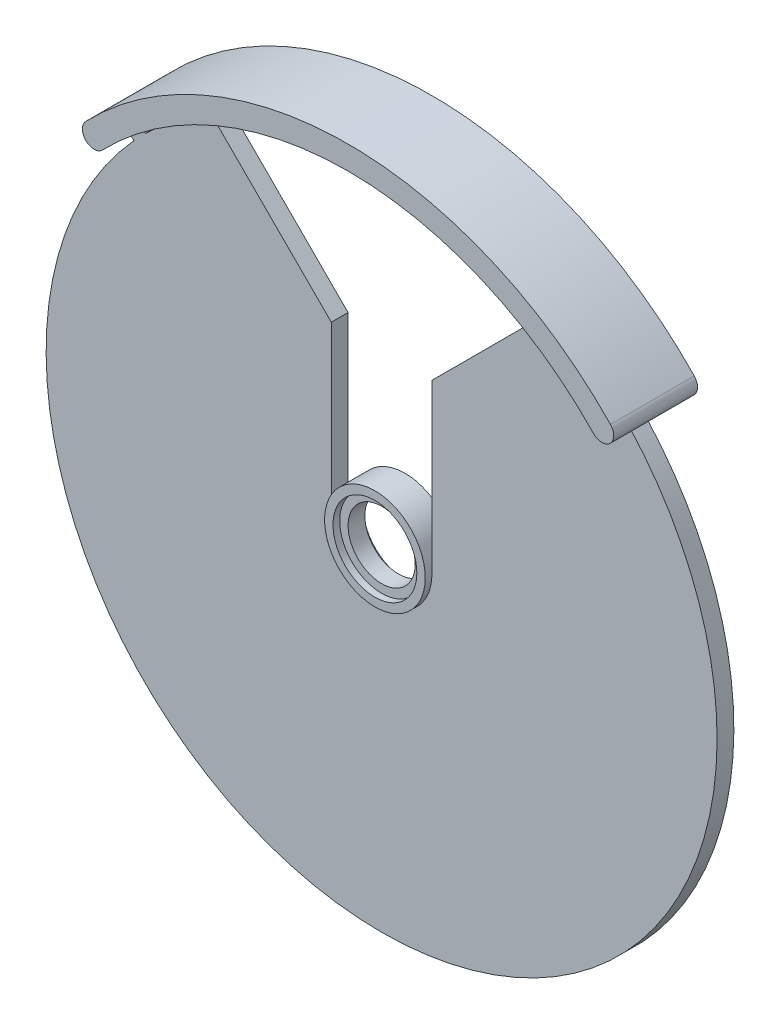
ISO-10303-21;
HEADER;
FILE_DESCRIPTION(('STEP AP214'),'2;1');
FILE_NAME('part.step','',(''),(''),'','','');
FILE_SCHEMA(('AUTOMOTIVE_DESIGN { 1 0 10303 214 1 1 1 1 }'));
ENDSEC;
DATA;
#1=APPLICATION_CONTEXT('core data for automotive mechanical design processes');
#2=APPLICATION_PROTOCOL_DEFINITION('international standard','automotive_design',2000,#1);
#3=PRODUCT_CONTEXT('',#1,'mechanical');
#4=PRODUCT('Part','Part','',(#3));
#5=PRODUCT_RELATED_PRODUCT_CATEGORY('part','',(#4));
#6=PRODUCT_DEFINITION_FORMATION('','',#4);
#7=PRODUCT_DEFINITION_CONTEXT('part definition',#1,'design');
#8=PRODUCT_DEFINITION('design','',#6,#7);
#9=PRODUCT_DEFINITION_SHAPE('','',#8);
#10=(LENGTH_UNIT() NAMED_UNIT(*) SI_UNIT(.MILLI.,.METRE.));
#11=(NAMED_UNIT(*) PLANE_ANGLE_UNIT() SI_UNIT($,.RADIAN.));
#12=(NAMED_UNIT(*) SI_UNIT($,.STERADIAN.) SOLID_ANGLE_UNIT());
#13=UNCERTAINTY_MEASURE_WITH_UNIT(LENGTH_MEASURE(1.E-05),#10,'distance_accuracy_value','');
#14=(GEOMETRIC_REPRESENTATION_CONTEXT(3) GLOBAL_UNCERTAINTY_ASSIGNED_CONTEXT((#13)) GLOBAL_UNIT_ASSIGNED_CONTEXT((#10,
#11,#12)) REPRESENTATION_CONTEXT('',''));
#15=CARTESIAN_POINT('',(0.,0.,0.));
#16=DIRECTION('',(0.,0.,1.));
#17=DIRECTION('',(1.,0.,0.));
#18=AXIS2_PLACEMENT_3D('',#15,#16,#17);
#19=CARTESIAN_POINT('',(0.,0.,1.27));
#20=DIRECTION('',(0.,0.,1.));
#21=DIRECTION('',(1.,0.,0.));
#22=AXIS2_PLACEMENT_3D('',#19,#20,#21);
#23=PLANE('',#22);
#24=CARTESIAN_POINT('',(19.224441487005,18.4896662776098,1.27));
#25=DIRECTION('',(0.,0.,1.));
#26=DIRECTION('',(1.,0.,0.));
#27=AXIS2_PLACEMENT_3D('',#24,#25,#26);
#28=CIRCLE('',#27,0.889);
#29=CARTESIAN_POINT('',(18.5836979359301,17.8734125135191,1.27));
#30=VERTEX_POINT('',#29);
#31=CARTESIAN_POINT('',(19.224441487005,17.6006662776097,1.27));
#32=VERTEX_POINT('',#31);
#33=EDGE_CURVE('E282',#30,#32,#28,.T.);
#34=ORIENTED_EDGE('',*,*,#33,.F.);
#35=CARTESIAN_POINT('',(0.,0.,1.27));
#36=DIRECTION('',(0.,0.,1.));
#37=DIRECTION('',(1.,0.,0.));
#38=AXIS2_PLACEMENT_3D('',#35,#36,#37);
#39=CIRCLE('',#38,25.7839621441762);
#40=CARTESIAN_POINT('',(18.1547390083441,18.3089637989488,1.27));
#41=VERTEX_POINT('',#40);
#42=EDGE_CURVE('E284',#30,#41,#39,.T.);
#43=ORIENTED_EDGE('',*,*,#42,.T.);
#44=DIRECTION('',(0.707106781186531,0.707106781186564,0.));
#45=VECTOR('',#44,1.);
#46=CARTESIAN_POINT('',(-0.0771123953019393,0.0771123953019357,1.27));
#47=LINE('',#46,#45);
#48=CARTESIAN_POINT('',(17.8832343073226,18.0374590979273,1.27));
#49=VERTEX_POINT('',#48);
#50=EDGE_CURVE('E330',#49,#41,#47,.T.);
#51=ORIENTED_EDGE('',*,*,#50,.F.);
#52=CARTESIAN_POINT('',(0.,0.,1.27));
#53=DIRECTION('',(0.,0.,1.));
#54=DIRECTION('',(1.,0.,0.));
#55=AXIS2_PLACEMENT_3D('',#52,#53,#54);
#56=CIRCLE('',#55,25.4);
#57=CARTESIAN_POINT('',(12.9567807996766,21.8467807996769,1.27));
#58=VERTEX_POINT('',#57);
#59=EDGE_CURVE('E219',#49,#58,#56,.T.);
#60=ORIENTED_EDGE('',*,*,#59,.T.);
#61=DIRECTION('',(0.707106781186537,0.707106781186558,0.));
#62=VECTOR('',#61,1.);
#63=CARTESIAN_POINT('',(-4.44499999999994,4.44499999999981,1.27));
#64=LINE('',#63,#62);
#65=CARTESIAN_POINT('',(3.81,12.7,1.27));
#66=VERTEX_POINT('',#65);
#67=EDGE_CURVE('E391',#66,#58,#64,.T.);
#68=ORIENTED_EDGE('',*,*,#67,.F.);
#69=DIRECTION('',(0.,1.,0.));
#70=VECTOR('',#69,1.);
#71=CARTESIAN_POINT('',(3.81,0.,1.27));
#72=LINE('',#71,#70);
#73=CARTESIAN_POINT('',(3.81,0.,1.27));
#74=VERTEX_POINT('',#73);
#75=EDGE_CURVE('E393',#74,#66,#72,.T.);
#76=ORIENTED_EDGE('',*,*,#75,.F.);
#77=CARTESIAN_POINT('',(0.,0.,1.27));
#78=DIRECTION('',(0.,0.,1.));
#79=DIRECTION('',(1.,0.,0.));
#80=AXIS2_PLACEMENT_3D('',#77,#78,#79);
#81=CIRCLE('',#80,3.81);
#82=CARTESIAN_POINT('',(-3.81,0.,1.27));
#83=VERTEX_POINT('',#82);
#84=EDGE_CURVE('E397',#83,#74,#81,.T.);
#85=ORIENTED_EDGE('',*,*,#84,.F.);
#86=DIRECTION('',(0.,1.,0.));
#87=VECTOR('',#86,1.);
#88=CARTESIAN_POINT('',(-3.81,0.,1.27));
#89=LINE('',#88,#87);
#90=CARTESIAN_POINT('',(-3.81,12.7,1.27));
#91=VERTEX_POINT('',#90);
#92=EDGE_CURVE('E384',#83,#91,#89,.T.);
#93=ORIENTED_EDGE('',*,*,#92,.T.);
#94=DIRECTION('',(-0.707106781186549,0.707106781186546,0.));
#95=VECTOR('',#94,1.);
#96=CARTESIAN_POINT('',(4.44500000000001,4.44500000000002,1.27));
#97=LINE('',#96,#95);
#98=CARTESIAN_POINT('',(-12.9567807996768,21.8467807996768,1.27));
#99=VERTEX_POINT('',#98);
#100=EDGE_CURVE('E389',#91,#99,#97,.T.);
#101=ORIENTED_EDGE('',*,*,#100,.T.);
#102=CARTESIAN_POINT('',(-17.8832343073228,18.0374590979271,1.27));
#103=VERTEX_POINT('',#102);
#104=EDGE_CURVE('E220',#99,#103,#56,.T.);
#105=ORIENTED_EDGE('',*,*,#104,.T.);
#106=DIRECTION('',(-0.707106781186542,0.707106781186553,0.));
#107=VECTOR('',#106,1.);
#108=CARTESIAN_POINT('',(0.0771123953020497,0.0771123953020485,1.27));
#109=LINE('',#108,#107);
#110=CARTESIAN_POINT('',(-18.1547390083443,18.3089637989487,1.27));
#111=VERTEX_POINT('',#110);
#112=EDGE_CURVE('E206',#103,#111,#109,.T.);
#113=ORIENTED_EDGE('',*,*,#112,.T.);
#114=CARTESIAN_POINT('',(-18.5836979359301,17.8734125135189,1.27));
#115=VERTEX_POINT('',#114);
#116=EDGE_CURVE('E50',#111,#115,#39,.T.);
#117=ORIENTED_EDGE('',*,*,#116,.T.);
#118=CARTESIAN_POINT('',(-19.2244414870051,18.4896662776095,1.27));
#119=DIRECTION('',(0.,0.,1.));
#120=DIRECTION('',(1.,0.,0.));
#121=AXIS2_PLACEMENT_3D('',#118,#119,#120);
#122=CIRCLE('',#121,0.889);
#123=CARTESIAN_POINT('',(-19.2244414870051,17.6006662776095,1.27));
#124=VERTEX_POINT('',#123);
#125=EDGE_CURVE('E226',#124,#115,#122,.T.);
#126=ORIENTED_EDGE('',*,*,#125,.F.);
#127=DIRECTION('',(-0.707106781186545,0.70710678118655,0.));
#128=VECTOR('',#127,1.);
#129=CARTESIAN_POINT('',(-0.811887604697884,-0.811887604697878,1.27));
#130=LINE('',#129,#128);
#131=CARTESIAN_POINT('',(-18.7540401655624,17.1302649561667,1.27));
#132=VERTEX_POINT('',#131);
#133=EDGE_CURVE('E200',#132,#124,#130,.T.);
#134=ORIENTED_EDGE('',*,*,#133,.F.);
#135=CARTESIAN_POINT('',(18.7540401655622,17.1302649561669,1.27));
#136=VERTEX_POINT('',#135);
#137=EDGE_CURVE('E215',#132,#136,#56,.T.);
#138=ORIENTED_EDGE('',*,*,#137,.T.);
#139=DIRECTION('',(-0.707106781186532,-0.707106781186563,0.));
#140=VECTOR('',#139,1.);
#141=CARTESIAN_POINT('',(0.811887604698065,-0.811887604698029,1.27));
#142=LINE('',#141,#140);
#143=EDGE_CURVE('E286',#32,#136,#142,.T.);
#144=ORIENTED_EDGE('',*,*,#143,.F.);
#145=EDGE_LOOP('',(#34,#43,#51,#60,#68,#76,#85,#93,#101,#105,#113,#117,#126,#134,#138,#144));
#146=FACE_BOUND('',#145,.T.);
#147=ADVANCED_FACE('F35',(#146),#23,.T.);
#148=CARTESIAN_POINT('',(0.,0.,0.));
#149=DIRECTION('',(0.,0.,1.));
#150=DIRECTION('',(1.,0.,0.));
#151=AXIS2_PLACEMENT_3D('',#148,#149,#150);
#152=PLANE('',#151);
#153=CARTESIAN_POINT('',(0.,0.,0.));
#154=DIRECTION('',(0.,0.,1.));
#155=DIRECTION('',(1.,0.,0.));
#156=AXIS2_PLACEMENT_3D('',#153,#154,#155);
#157=CIRCLE('',#156,25.7839621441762);
#158=CARTESIAN_POINT('',(18.5836979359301,17.8734125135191,0.));
#159=VERTEX_POINT('',#158);
#160=CARTESIAN_POINT('',(18.1547390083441,18.3089637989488,0.));
#161=VERTEX_POINT('',#160);
#162=EDGE_CURVE('E58',#159,#161,#157,.T.);
#163=ORIENTED_EDGE('',*,*,#162,.F.);
#164=CARTESIAN_POINT('',(19.224441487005,18.4896662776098,0.));
#165=DIRECTION('',(0.,0.,-1.));
#166=DIRECTION('',(-1.,0.,0.));
#167=AXIS2_PLACEMENT_3D('',#164,#165,#166);
#168=CIRCLE('',#167,0.889);
#169=CARTESIAN_POINT('',(19.224441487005,17.6006662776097,0.));
#170=VERTEX_POINT('',#169);
#171=EDGE_CURVE('E324',#170,#159,#168,.T.);
#172=ORIENTED_EDGE('',*,*,#171,.F.);
#173=DIRECTION('',(-0.707106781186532,-0.707106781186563,0.));
#174=VECTOR('',#173,1.);
#175=CARTESIAN_POINT('',(0.811887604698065,-0.811887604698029,0.));
#176=LINE('',#175,#174);
#177=CARTESIAN_POINT('',(18.7540401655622,17.1302649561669,0.));
#178=VERTEX_POINT('',#177);
#179=EDGE_CURVE('E333',#170,#178,#176,.T.);
#180=ORIENTED_EDGE('',*,*,#179,.T.);
#181=CARTESIAN_POINT('',(0.,0.,0.));
#182=DIRECTION('',(0.,0.,1.));
#183=DIRECTION('',(1.,0.,0.));
#184=AXIS2_PLACEMENT_3D('',#181,#182,#183);
#185=CIRCLE('',#184,25.4);
#186=CARTESIAN_POINT('',(-18.7540401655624,17.1302649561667,0.));
#187=VERTEX_POINT('',#186);
#188=EDGE_CURVE('E221',#187,#178,#185,.T.);
#189=ORIENTED_EDGE('',*,*,#188,.F.);
#190=DIRECTION('',(0.707106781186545,-0.70710678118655,0.));
#191=VECTOR('',#190,1.);
#192=CARTESIAN_POINT('',(-0.811887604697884,-0.811887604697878,0.));
#193=LINE('',#192,#191);
#194=CARTESIAN_POINT('',(-19.2244414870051,17.6006662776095,0.));
#195=VERTEX_POINT('',#194);
#196=EDGE_CURVE('E347',#195,#187,#193,.T.);
#197=ORIENTED_EDGE('',*,*,#196,.F.);
#198=CARTESIAN_POINT('',(-19.2244414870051,18.4896662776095,0.));
#199=DIRECTION('',(0.,0.,1.));
#200=DIRECTION('',(1.,0.,0.));
#201=AXIS2_PLACEMENT_3D('',#198,#199,#200);
#202=CIRCLE('',#201,0.889);
#203=CARTESIAN_POINT('',(-18.5836979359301,17.8734125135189,0.));
#204=VERTEX_POINT('',#203);
#205=EDGE_CURVE('E218',#204,#195,#202,.F.);
#206=ORIENTED_EDGE('',*,*,#205,.F.);
#207=CARTESIAN_POINT('',(-18.1547390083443,18.3089637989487,0.));
#208=VERTEX_POINT('',#207);
#209=EDGE_CURVE('E189',#208,#204,#157,.T.);
#210=ORIENTED_EDGE('',*,*,#209,.F.);
#211=DIRECTION('',(0.707106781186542,-0.707106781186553,0.));
#212=VECTOR('',#211,1.);
#213=CARTESIAN_POINT('',(0.0771123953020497,0.0771123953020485,0.));
#214=LINE('',#213,#212);
#215=CARTESIAN_POINT('',(-17.8832343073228,18.0374590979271,0.));
#216=VERTEX_POINT('',#215);
#217=EDGE_CURVE('E340',#208,#216,#214,.T.);
#218=ORIENTED_EDGE('',*,*,#217,.T.);
#219=CARTESIAN_POINT('',(-12.9567807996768,21.8467807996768,0.));
#220=VERTEX_POINT('',#219);
#221=EDGE_CURVE('E213',#220,#216,#185,.T.);
#222=ORIENTED_EDGE('',*,*,#221,.F.);
#223=DIRECTION('',(-0.707106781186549,0.707106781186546,0.));
#224=VECTOR('',#223,1.);
#225=CARTESIAN_POINT('',(4.44500000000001,4.44500000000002,0.));
#226=LINE('',#225,#224);
#227=CARTESIAN_POINT('',(-3.81,12.7,0.));
#228=VERTEX_POINT('',#227);
#229=EDGE_CURVE('E290',#228,#220,#226,.T.);
#230=ORIENTED_EDGE('',*,*,#229,.F.);
#231=DIRECTION('',(0.,1.,0.));
#232=VECTOR('',#231,1.);
#233=CARTESIAN_POINT('',(-3.81,0.,0.));
#234=LINE('',#233,#232);
#235=CARTESIAN_POINT('',(-3.81,0.,0.));
#236=VERTEX_POINT('',#235);
#237=EDGE_CURVE('E250',#236,#228,#234,.T.);
#238=ORIENTED_EDGE('',*,*,#237,.F.);
#239=CARTESIAN_POINT('',(0.,0.,0.));
#240=DIRECTION('',(0.,0.,1.));
#241=DIRECTION('',(1.,0.,0.));
#242=AXIS2_PLACEMENT_3D('',#239,#240,#241);
#243=CIRCLE('',#242,3.81);
#244=CARTESIAN_POINT('',(3.81,0.,0.));
#245=VERTEX_POINT('',#244);
#246=EDGE_CURVE('E302',#236,#245,#243,.T.);
#247=ORIENTED_EDGE('',*,*,#246,.T.);
#248=DIRECTION('',(0.,1.,0.));
#249=VECTOR('',#248,1.);
#250=CARTESIAN_POINT('',(3.81,0.,0.));
#251=LINE('',#250,#249);
#252=CARTESIAN_POINT('',(3.81,12.7,0.));
#253=VERTEX_POINT('',#252);
#254=EDGE_CURVE('E247',#245,#253,#251,.T.);
#255=ORIENTED_EDGE('',*,*,#254,.T.);
#256=DIRECTION('',(0.707106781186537,0.707106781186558,0.));
#257=VECTOR('',#256,1.);
#258=CARTESIAN_POINT('',(-4.44499999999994,4.44499999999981,0.));
#259=LINE('',#258,#257);
#260=CARTESIAN_POINT('',(12.9567807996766,21.8467807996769,0.));
#261=VERTEX_POINT('',#260);
#262=EDGE_CURVE('E370',#253,#261,#259,.T.);
#263=ORIENTED_EDGE('',*,*,#262,.T.);
#264=CARTESIAN_POINT('',(17.8832343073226,18.0374590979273,0.));
#265=VERTEX_POINT('',#264);
#266=EDGE_CURVE('E224',#265,#261,#185,.T.);
#267=ORIENTED_EDGE('',*,*,#266,.F.);
#268=DIRECTION('',(0.707106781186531,0.707106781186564,0.));
#269=VECTOR('',#268,1.);
#270=CARTESIAN_POINT('',(-0.0771123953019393,0.0771123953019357,0.));
#271=LINE('',#270,#269);
#272=EDGE_CURVE('E331',#265,#161,#271,.T.);
#273=ORIENTED_EDGE('',*,*,#272,.T.);
#274=EDGE_LOOP('',(#163,#172,#180,#189,#197,#206,#210,#218,#222,#230,#238,#247,#255,#263,#267,#273));
#275=FACE_BOUND('',#274,.T.);
#276=ADVANCED_FACE('F270',(#275),#152,.F.);
#277=CARTESIAN_POINT('',(0.0771123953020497,0.0771123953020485,2.54));
#278=DIRECTION('',(0.707106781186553,0.707106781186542,0.));
#279=DIRECTION('',(-0.707106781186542,0.707106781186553,0.));
#280=AXIS2_PLACEMENT_3D('',#277,#278,#279);
#281=PLANE('',#280);
#282=ORIENTED_EDGE('',*,*,#217,.F.);
#283=DIRECTION('',(0.,0.,1.));
#284=VECTOR('',#283,1.);
#285=CARTESIAN_POINT('',(-18.1547390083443,18.3089637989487,-43.9818813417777));
#286=LINE('',#285,#284);
#287=EDGE_CURVE('E295',#208,#111,#286,.T.);
#288=ORIENTED_EDGE('',*,*,#287,.T.);
#289=ORIENTED_EDGE('',*,*,#112,.F.);
#290=DIRECTION('',(0.,0.,-1.));
#291=VECTOR('',#290,1.);
#292=CARTESIAN_POINT('',(-17.8832343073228,18.0374590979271,2.54));
#293=LINE('',#292,#291);
#294=EDGE_CURVE('E210',#103,#216,#293,.T.);
#295=ORIENTED_EDGE('',*,*,#294,.T.);
#296=EDGE_LOOP('',(#282,#288,#289,#295));
#297=FACE_BOUND('',#296,.T.);
#298=ADVANCED_FACE('F278',(#297),#281,.T.);
#299=CARTESIAN_POINT('',(19.224441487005,18.4896662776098,0.));
#300=DIRECTION('',(0.,0.,1.));
#301=DIRECTION('',(1.,0.,0.));
#302=AXIS2_PLACEMENT_3D('',#299,#300,#301);
#303=CYLINDRICAL_SURFACE('',#302,0.889000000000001);
#304=DIRECTION('',(0.,0.,1.));
#305=VECTOR('',#304,1.);
#306=CARTESIAN_POINT('',(18.58369793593,17.8734125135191,-43.9818813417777));
#307=LINE('',#306,#305);
#308=CARTESIAN_POINT('',(18.5836979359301,17.8734125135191,-2.54));
#309=VERTEX_POINT('',#308);
#310=EDGE_CURVE('E308',#309,#159,#307,.T.);
#311=ORIENTED_EDGE('',*,*,#310,.F.);
#312=CARTESIAN_POINT('',(19.224441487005,18.4896662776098,-2.54));
#313=DIRECTION('',(0.,0.,-1.));
#314=DIRECTION('',(-1.,0.,0.));
#315=AXIS2_PLACEMENT_3D('',#312,#313,#314);
#316=CIRCLE('',#315,0.889);
#317=CARTESIAN_POINT('',(19.86518503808,19.1059200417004,-2.54));
#318=VERTEX_POINT('',#317);
#319=EDGE_CURVE('E181',#318,#309,#316,.T.);
#320=ORIENTED_EDGE('',*,*,#319,.F.);
#321=DIRECTION('',(0.,0.,1.));
#322=VECTOR('',#321,1.);
#323=CARTESIAN_POINT('',(19.86518503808,19.1059200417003,-43.9818813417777));
#324=LINE('',#323,#322);
#325=CARTESIAN_POINT('',(19.86518503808,19.1059200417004,3.81));
#326=VERTEX_POINT('',#325);
#327=EDGE_CURVE('E311',#318,#326,#324,.T.);
#328=ORIENTED_EDGE('',*,*,#327,.T.);
#329=CARTESIAN_POINT('',(19.224441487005,18.4896662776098,3.81));
#330=DIRECTION('',(0.,0.,1.));
#331=DIRECTION('',(1.,0.,0.));
#332=AXIS2_PLACEMENT_3D('',#329,#330,#331);
#333=CIRCLE('',#332,0.889);
#334=CARTESIAN_POINT('',(18.5836979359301,17.8734125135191,3.81));
#335=VERTEX_POINT('',#334);
#336=EDGE_CURVE('E289',#335,#326,#333,.T.);
#337=ORIENTED_EDGE('',*,*,#336,.F.);
#338=EDGE_CURVE('E192',#30,#335,#307,.T.);
#339=ORIENTED_EDGE('',*,*,#338,.F.);
#340=ORIENTED_EDGE('',*,*,#33,.T.);
#341=DIRECTION('',(0.,0.,1.));
#342=VECTOR('',#341,1.);
#343=CARTESIAN_POINT('',(19.224441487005,17.6006662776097,0.));
#344=LINE('',#343,#342);
#345=EDGE_CURVE('E338',#170,#32,#344,.T.);
#346=ORIENTED_EDGE('',*,*,#345,.F.);
#347=ORIENTED_EDGE('',*,*,#171,.T.);
#348=EDGE_LOOP('',(#311,#320,#328,#337,#339,#340,#346,#347));
#349=FACE_BOUND('',#348,.T.);
#350=ADVANCED_FACE('F458',(#349),#303,.T.);
#351=CARTESIAN_POINT('',(-0.0771123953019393,0.0771123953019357,0.));
#352=DIRECTION('',(0.707106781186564,-0.707106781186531,0.));
#353=DIRECTION('',(0.707106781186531,0.707106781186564,0.));
#354=AXIS2_PLACEMENT_3D('',#351,#352,#353);
#355=PLANE('',#354);
#356=DIRECTION('',(0.,0.,1.));
#357=VECTOR('',#356,1.);
#358=CARTESIAN_POINT('',(18.1547390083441,18.3089637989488,-43.9818813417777));
#359=LINE('',#358,#357);
#360=EDGE_CURVE('E294',#161,#41,#359,.T.);
#361=ORIENTED_EDGE('',*,*,#360,.F.);
#362=ORIENTED_EDGE('',*,*,#272,.F.);
#363=DIRECTION('',(0.,0.,1.));
#364=VECTOR('',#363,1.);
#365=CARTESIAN_POINT('',(17.8832343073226,18.0374590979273,0.));
#366=LINE('',#365,#364);
#367=EDGE_CURVE('E335',#265,#49,#366,.T.);
#368=ORIENTED_EDGE('',*,*,#367,.T.);
#369=ORIENTED_EDGE('',*,*,#50,.T.);
#370=EDGE_LOOP('',(#361,#362,#368,#369));
#371=FACE_BOUND('',#370,.T.);
#372=ADVANCED_FACE('F268',(#371),#355,.F.);
#373=CARTESIAN_POINT('',(0.,0.,0.));
#374=DIRECTION('',(0.,0.,1.));
#375=DIRECTION('',(1.,0.,0.));
#376=AXIS2_PLACEMENT_3D('',#373,#374,#375);
#377=CIRCLE('',#376,2.54);
#378=CARTESIAN_POINT('',(2.54,0.,0.));
#379=VERTEX_POINT('',#378);
#380=EDGE_CURVE('E199',#379,#379,#377,.T.);
#381=ORIENTED_EDGE('',*,*,#380,.T.);
#382=EDGE_LOOP('',(#381));
#383=FACE_BOUND('',#382,.T.);
#384=CARTESIAN_POINT('',(0.,0.,0.));
#385=DIRECTION('',(0.,0.,1.));
#386=DIRECTION('',(1.,0.,0.));
#387=AXIS2_PLACEMENT_3D('',#384,#385,#386);
#388=CIRCLE('',#387,3.175);
#389=CARTESIAN_POINT('',(3.175,0.,0.));
#390=VERTEX_POINT('',#389);
#391=EDGE_CURVE('E11',#390,#390,#388,.T.);
#392=ORIENTED_EDGE('',*,*,#391,.F.);
#393=EDGE_LOOP('',(#392));
#394=FACE_BOUND('',#393,.T.);
#395=ADVANCED_FACE('F259',(#383,#394),#152,.F.);
#396=CARTESIAN_POINT('',(0.,0.,1.27));
#397=DIRECTION('',(0.,0.,1.));
#398=DIRECTION('',(1.,0.,0.));
#399=AXIS2_PLACEMENT_3D('',#396,#397,#398);
#400=CIRCLE('',#399,2.54);
#401=CARTESIAN_POINT('',(2.54,0.,1.27));
#402=VERTEX_POINT('',#401);
#403=EDGE_CURVE('E203',#402,#402,#400,.T.);
#404=ORIENTED_EDGE('',*,*,#403,.F.);
#405=EDGE_LOOP('',(#404));
#406=FACE_BOUND('',#405,.T.);
#407=CARTESIAN_POINT('',(0.,0.,1.27));
#408=DIRECTION('',(0.,0.,1.));
#409=DIRECTION('',(1.,0.,0.));
#410=AXIS2_PLACEMENT_3D('',#407,#408,#409);
#411=CIRCLE('',#410,3.175);
#412=CARTESIAN_POINT('',(3.175,0.,1.27));
#413=VERTEX_POINT('',#412);
#414=EDGE_CURVE('E43',#413,#413,#411,.F.);
#415=ORIENTED_EDGE('',*,*,#414,.F.);
#416=EDGE_LOOP('',(#415));
#417=FACE_BOUND('',#416,.T.);
#418=ADVANCED_FACE('F256',(#406,#417),#23,.T.);
#419=CARTESIAN_POINT('',(0.,0.,1.27));
#420=DIRECTION('',(0.,0.,-1.));
#421=DIRECTION('',(-1.,0.,0.));
#422=AXIS2_PLACEMENT_3D('',#419,#420,#421);
#423=CYLINDRICAL_SURFACE('',#422,25.4);
#424=DIRECTION('',(0.,0.,-1.));
#425=VECTOR('',#424,1.);
#426=CARTESIAN_POINT('',(-12.9567807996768,21.8467807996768,1.27));
#427=LINE('',#426,#425);
#428=EDGE_CURVE('E245',#220,#99,#427,.F.);
#429=ORIENTED_EDGE('',*,*,#428,.F.);
#430=ORIENTED_EDGE('',*,*,#221,.T.);
#431=ORIENTED_EDGE('',*,*,#294,.F.);
#432=ORIENTED_EDGE('',*,*,#104,.F.);
#433=EDGE_LOOP('',(#429,#430,#431,#432));
#434=FACE_BOUND('',#433,.T.);
#435=ADVANCED_FACE('F258',(#434),#423,.T.);
#436=DIRECTION('',(0.,0.,1.));
#437=VECTOR('',#436,1.);
#438=CARTESIAN_POINT('',(18.7540401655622,17.1302649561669,0.));
#439=LINE('',#438,#437);
#440=EDGE_CURVE('E341',#178,#136,#439,.T.);
#441=ORIENTED_EDGE('',*,*,#440,.T.);
#442=ORIENTED_EDGE('',*,*,#137,.F.);
#443=DIRECTION('',(0.,0.,-1.));
#444=VECTOR('',#443,1.);
#445=CARTESIAN_POINT('',(-18.7540401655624,17.1302649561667,2.54));
#446=LINE('',#445,#444);
#447=EDGE_CURVE('E240',#132,#187,#446,.T.);
#448=ORIENTED_EDGE('',*,*,#447,.T.);
#449=ORIENTED_EDGE('',*,*,#188,.T.);
#450=EDGE_LOOP('',(#441,#442,#448,#449));
#451=FACE_BOUND('',#450,.T.);
#452=ADVANCED_FACE('F37',(#451),#423,.T.);
#453=ORIENTED_EDGE('',*,*,#266,.T.);
#454=DIRECTION('',(0.,0.,-1.));
#455=VECTOR('',#454,1.);
#456=CARTESIAN_POINT('',(12.9567807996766,21.8467807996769,1.27));
#457=LINE('',#456,#455);
#458=EDGE_CURVE('E232',#261,#58,#457,.F.);
#459=ORIENTED_EDGE('',*,*,#458,.T.);
#460=ORIENTED_EDGE('',*,*,#59,.F.);
#461=ORIENTED_EDGE('',*,*,#367,.F.);
#462=EDGE_LOOP('',(#453,#459,#460,#461));
#463=FACE_BOUND('',#462,.T.);
#464=ADVANCED_FACE('F267',(#463),#423,.T.);
#465=CARTESIAN_POINT('',(0.,0.,1.27));
#466=DIRECTION('',(0.,0.,-1.));
#467=DIRECTION('',(-1.,0.,0.));
#468=AXIS2_PLACEMENT_3D('',#465,#466,#467);
#469=CYLINDRICAL_SURFACE('',#468,2.54);
#470=ORIENTED_EDGE('',*,*,#403,.T.);
#471=EDGE_LOOP('',(#470));
#472=FACE_BOUND('',#471,.T.);
#473=ORIENTED_EDGE('',*,*,#380,.F.);
#474=EDGE_LOOP('',(#473));
#475=FACE_BOUND('',#474,.T.);
#476=ADVANCED_FACE('F470',(#472,#475),#469,.F.);
#477=CARTESIAN_POINT('',(-19.2244414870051,18.4896662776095,-2.54));
#478=DIRECTION('',(0.,0.,1.));
#479=DIRECTION('',(1.,0.,0.));
#480=AXIS2_PLACEMENT_3D('',#477,#478,#479);
#481=CYLINDRICAL_SURFACE('',#480,0.889);
#482=CARTESIAN_POINT('',(-19.2244414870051,18.4896662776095,-2.54));
#483=DIRECTION('',(0.,0.,-1.));
#484=DIRECTION('',(-1.,0.,0.));
#485=AXIS2_PLACEMENT_3D('',#482,#483,#484);
#486=CIRCLE('',#485,0.889);
#487=CARTESIAN_POINT('',(-18.5836979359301,17.8734125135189,-2.54));
#488=VERTEX_POINT('',#487);
#489=CARTESIAN_POINT('',(-19.8651850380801,19.1059200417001,-2.54));
#490=VERTEX_POINT('',#489);
#491=EDGE_CURVE('E180',#488,#490,#486,.T.);
#492=ORIENTED_EDGE('',*,*,#491,.F.);
#493=DIRECTION('',(0.,0.,1.));
#494=VECTOR('',#493,1.);
#495=CARTESIAN_POINT('',(-18.5836979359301,17.8734125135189,-43.9818813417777));
#496=LINE('',#495,#494);
#497=EDGE_CURVE('E186',#488,#204,#496,.T.);
#498=ORIENTED_EDGE('',*,*,#497,.T.);
#499=ORIENTED_EDGE('',*,*,#205,.T.);
#500=DIRECTION('',(0.,0.,-1.));
#501=VECTOR('',#500,1.);
#502=CARTESIAN_POINT('',(-19.2244414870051,17.6006662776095,2.54));
#503=LINE('',#502,#501);
#504=EDGE_CURVE('E237',#124,#195,#503,.T.);
#505=ORIENTED_EDGE('',*,*,#504,.F.);
#506=ORIENTED_EDGE('',*,*,#125,.T.);
#507=CARTESIAN_POINT('',(-18.5836979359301,17.8734125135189,3.81));
#508=VERTEX_POINT('',#507);
#509=EDGE_CURVE('E193',#115,#508,#496,.T.);
#510=ORIENTED_EDGE('',*,*,#509,.T.);
#511=CARTESIAN_POINT('',(-19.2244414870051,18.4896662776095,3.81));
#512=DIRECTION('',(0.,0.,1.));
#513=DIRECTION('',(1.,0.,0.));
#514=AXIS2_PLACEMENT_3D('',#511,#512,#513);
#515=CIRCLE('',#514,0.889);
#516=CARTESIAN_POINT('',(-19.8651850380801,19.1059200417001,3.81));
#517=VERTEX_POINT('',#516);
#518=EDGE_CURVE('E320',#517,#508,#515,.T.);
#519=ORIENTED_EDGE('',*,*,#518,.F.);
#520=DIRECTION('',(0.,0.,1.));
#521=VECTOR('',#520,1.);
#522=CARTESIAN_POINT('',(-19.8651850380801,19.1059200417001,-43.9818813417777));
#523=LINE('',#522,#521);
#524=EDGE_CURVE('E198',#490,#517,#523,.T.);
#525=ORIENTED_EDGE('',*,*,#524,.F.);
#526=EDGE_LOOP('',(#492,#498,#499,#505,#506,#510,#519,#525));
#527=FACE_BOUND('',#526,.T.);
#528=ADVANCED_FACE('F196',(#527),#481,.T.);
#529=CARTESIAN_POINT('',(-19.2244414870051,18.4896662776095,-2.54));
#530=DIRECTION('',(0.,0.,-1.));
#531=DIRECTION('',(-1.,0.,0.));
#532=AXIS2_PLACEMENT_3D('',#529,#530,#531);
#533=PLANE('',#532);
#534=ORIENTED_EDGE('',*,*,#491,.T.);
#535=CARTESIAN_POINT('',(0.,0.,-2.54));
#536=DIRECTION('',(0.,0.,-1.));
#537=DIRECTION('',(-1.,0.,0.));
#538=AXIS2_PLACEMENT_3D('',#535,#536,#537);
#539=CIRCLE('',#538,27.5619621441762);
#540=EDGE_CURVE('E306',#318,#490,#539,.F.);
#541=ORIENTED_EDGE('',*,*,#540,.F.);
#542=ORIENTED_EDGE('',*,*,#319,.T.);
#543=CARTESIAN_POINT('',(0.,0.,-2.54));
#544=DIRECTION('',(0.,0.,-1.));
#545=DIRECTION('',(-1.,0.,0.));
#546=AXIS2_PLACEMENT_3D('',#543,#544,#545);
#547=CIRCLE('',#546,25.7839621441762);
#548=EDGE_CURVE('E175',#309,#488,#547,.F.);
#549=ORIENTED_EDGE('',*,*,#548,.T.);
#550=EDGE_LOOP('',(#534,#541,#542,#549));
#551=FACE_BOUND('',#550,.T.);
#552=ADVANCED_FACE('F177',(#551),#533,.T.);
#553=CARTESIAN_POINT('',(-0.811887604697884,-0.811887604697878,2.54));
#554=DIRECTION('',(0.70710678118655,0.707106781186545,0.));
#555=DIRECTION('',(-0.707106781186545,0.70710678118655,0.));
#556=AXIS2_PLACEMENT_3D('',#553,#554,#555);
#557=PLANE('',#556);
#558=ORIENTED_EDGE('',*,*,#133,.T.);
#559=ORIENTED_EDGE('',*,*,#504,.T.);
#560=ORIENTED_EDGE('',*,*,#196,.T.);
#561=ORIENTED_EDGE('',*,*,#447,.F.);
#562=EDGE_LOOP('',(#558,#559,#560,#561));
#563=FACE_BOUND('',#562,.T.);
#564=ADVANCED_FACE('F454',(#563),#557,.F.);
#565=CARTESIAN_POINT('',(0.811887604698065,-0.811887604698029,0.));
#566=DIRECTION('',(-0.707106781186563,0.707106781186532,0.));
#567=DIRECTION('',(-0.707106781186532,-0.707106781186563,0.));
#568=AXIS2_PLACEMENT_3D('',#565,#566,#567);
#569=PLANE('',#568);
#570=ORIENTED_EDGE('',*,*,#143,.T.);
#571=ORIENTED_EDGE('',*,*,#440,.F.);
#572=ORIENTED_EDGE('',*,*,#179,.F.);
#573=ORIENTED_EDGE('',*,*,#345,.T.);
#574=EDGE_LOOP('',(#570,#571,#572,#573));
#575=FACE_BOUND('',#574,.T.);
#576=ADVANCED_FACE('F451',(#575),#569,.F.);
#577=CARTESIAN_POINT('',(-19.2244414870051,18.4896662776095,3.81));
#578=DIRECTION('',(0.,0.,1.));
#579=DIRECTION('',(1.,0.,0.));
#580=AXIS2_PLACEMENT_3D('',#577,#578,#579);
#581=PLANE('',#580);
#582=ORIENTED_EDGE('',*,*,#518,.T.);
#583=CARTESIAN_POINT('',(0.,0.,3.81));
#584=DIRECTION('',(0.,0.,1.));
#585=DIRECTION('',(1.,0.,0.));
#586=AXIS2_PLACEMENT_3D('',#583,#584,#585);
#587=CIRCLE('',#586,25.7839621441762);
#588=EDGE_CURVE('E310',#335,#508,#587,.T.);
#589=ORIENTED_EDGE('',*,*,#588,.F.);
#590=ORIENTED_EDGE('',*,*,#336,.T.);
#591=CARTESIAN_POINT('',(0.,0.,3.81));
#592=DIRECTION('',(0.,0.,1.));
#593=DIRECTION('',(1.,0.,0.));
#594=AXIS2_PLACEMENT_3D('',#591,#592,#593);
#595=CIRCLE('',#594,27.5619621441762);
#596=EDGE_CURVE('E183',#326,#517,#595,.T.);
#597=ORIENTED_EDGE('',*,*,#596,.T.);
#598=EDGE_LOOP('',(#582,#589,#590,#597));
#599=FACE_BOUND('',#598,.T.);
#600=ADVANCED_FACE('F322',(#599),#581,.T.);
#601=CARTESIAN_POINT('',(0.,0.,-1.27));
#602=DIRECTION('',(0.,0.,1.));
#603=DIRECTION('',(1.,0.,0.));
#604=AXIS2_PLACEMENT_3D('',#601,#602,#603);
#605=CYLINDRICAL_SURFACE('',#604,3.81);
#606=DIRECTION('',(0.,0.,1.));
#607=VECTOR('',#606,1.);
#608=CARTESIAN_POINT('',(3.81,0.,-1.27));
#609=LINE('',#608,#607);
#610=EDGE_CURVE('E381',#245,#74,#609,.T.);
#611=ORIENTED_EDGE('',*,*,#610,.F.);
#612=ORIENTED_EDGE('',*,*,#246,.F.);
#613=DIRECTION('',(0.,0.,1.));
#614=VECTOR('',#613,1.);
#615=CARTESIAN_POINT('',(-3.81,0.,-1.27));
#616=LINE('',#615,#614);
#617=EDGE_CURVE('E374',#236,#83,#616,.T.);
#618=ORIENTED_EDGE('',*,*,#617,.T.);
#619=ORIENTED_EDGE('',*,*,#84,.T.);
#620=EDGE_LOOP('',(#611,#612,#618,#619));
#621=FACE_BOUND('',#620,.T.);
#622=CARTESIAN_POINT('',(0.,0.,1.778));
#623=DIRECTION('',(0.,0.,1.));
#624=DIRECTION('',(1.,0.,0.));
#625=AXIS2_PLACEMENT_3D('',#622,#623,#624);
#626=CIRCLE('',#625,3.81);
#627=CARTESIAN_POINT('',(3.81,0.,1.778));
#628=VERTEX_POINT('',#627);
#629=EDGE_CURVE('E396',#628,#628,#626,.T.);
#630=ORIENTED_EDGE('',*,*,#629,.F.);
#631=EDGE_LOOP('',(#630));
#632=FACE_BOUND('',#631,.T.);
#633=CARTESIAN_POINT('',(0.,0.,-0.508));
#634=DIRECTION('',(0.,0.,1.));
#635=DIRECTION('',(1.,0.,0.));
#636=AXIS2_PLACEMENT_3D('',#633,#634,#635);
#637=CIRCLE('',#636,3.81);
#638=CARTESIAN_POINT('',(3.81,0.,-0.508));
#639=VERTEX_POINT('',#638);
#640=EDGE_CURVE('E405',#639,#639,#637,.T.);
#641=ORIENTED_EDGE('',*,*,#640,.T.);
#642=EDGE_LOOP('',(#641));
#643=FACE_BOUND('',#642,.T.);
#644=ADVANCED_FACE('F410',(#621,#632,#643),#605,.T.);
#645=CARTESIAN_POINT('',(-3.81,0.,-1.27));
#646=DIRECTION('',(1.,0.,0.));
#647=DIRECTION('',(0.,0.,-1.));
#648=AXIS2_PLACEMENT_3D('',#645,#646,#647);
#649=PLANE('',#648);
#650=ORIENTED_EDGE('',*,*,#237,.T.);
#651=DIRECTION('',(0.,0.,1.));
#652=VECTOR('',#651,1.);
#653=CARTESIAN_POINT('',(-3.81,12.7,-1.27));
#654=LINE('',#653,#652);
#655=EDGE_CURVE('E378',#228,#91,#654,.T.);
#656=ORIENTED_EDGE('',*,*,#655,.T.);
#657=ORIENTED_EDGE('',*,*,#92,.F.);
#658=ORIENTED_EDGE('',*,*,#617,.F.);
#659=EDGE_LOOP('',(#650,#656,#657,#658));
#660=FACE_BOUND('',#659,.T.);
#661=ADVANCED_FACE('F432',(#660),#649,.T.);
#662=CARTESIAN_POINT('',(3.81,0.,-1.27));
#663=DIRECTION('',(1.,0.,0.));
#664=DIRECTION('',(0.,0.,-1.));
#665=AXIS2_PLACEMENT_3D('',#662,#663,#664);
#666=PLANE('',#665);
#667=ORIENTED_EDGE('',*,*,#610,.T.);
#668=ORIENTED_EDGE('',*,*,#75,.T.);
#669=DIRECTION('',(0.,0.,1.));
#670=VECTOR('',#669,1.);
#671=CARTESIAN_POINT('',(3.81,12.7,-1.27));
#672=LINE('',#671,#670);
#673=EDGE_CURVE('E383',#253,#66,#672,.T.);
#674=ORIENTED_EDGE('',*,*,#673,.F.);
#675=ORIENTED_EDGE('',*,*,#254,.F.);
#676=EDGE_LOOP('',(#667,#668,#674,#675));
#677=FACE_BOUND('',#676,.T.);
#678=ADVANCED_FACE('F435',(#677),#666,.F.);
#679=CARTESIAN_POINT('',(4.44500000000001,4.44500000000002,-1.27));
#680=DIRECTION('',(0.707106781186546,0.707106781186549,0.));
#681=DIRECTION('',(-0.707106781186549,0.707106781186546,0.));
#682=AXIS2_PLACEMENT_3D('',#679,#680,#681);
#683=PLANE('',#682);
#684=ORIENTED_EDGE('',*,*,#229,.T.);
#685=ORIENTED_EDGE('',*,*,#428,.T.);
#686=ORIENTED_EDGE('',*,*,#100,.F.);
#687=ORIENTED_EDGE('',*,*,#655,.F.);
#688=EDGE_LOOP('',(#684,#685,#686,#687));
#689=FACE_BOUND('',#688,.T.);
#690=ADVANCED_FACE('F437',(#689),#683,.T.);
#691=CARTESIAN_POINT('',(-4.44499999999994,4.44499999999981,-1.27));
#692=DIRECTION('',(0.707106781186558,-0.707106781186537,0.));
#693=DIRECTION('',(0.707106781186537,0.707106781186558,0.));
#694=AXIS2_PLACEMENT_3D('',#691,#692,#693);
#695=PLANE('',#694);
#696=ORIENTED_EDGE('',*,*,#673,.T.);
#697=ORIENTED_EDGE('',*,*,#67,.T.);
#698=ORIENTED_EDGE('',*,*,#458,.F.);
#699=ORIENTED_EDGE('',*,*,#262,.F.);
#700=EDGE_LOOP('',(#696,#697,#698,#699));
#701=FACE_BOUND('',#700,.T.);
#702=ADVANCED_FACE('F430',(#701),#695,.F.);
#703=CARTESIAN_POINT('',(0.,0.,1.778));
#704=DIRECTION('',(0.,0.,1.));
#705=DIRECTION('',(1.,0.,0.));
#706=AXIS2_PLACEMENT_3D('',#703,#704,#705);
#707=PLANE('',#706);
#708=ORIENTED_EDGE('',*,*,#629,.T.);
#709=EDGE_LOOP('',(#708));
#710=FACE_BOUND('',#709,.T.);
#711=CARTESIAN_POINT('',(0.,0.,1.778));
#712=DIRECTION('',(0.,0.,1.));
#713=DIRECTION('',(1.,0.,0.));
#714=AXIS2_PLACEMENT_3D('',#711,#712,#713);
#715=CIRCLE('',#714,3.175);
#716=CARTESIAN_POINT('',(3.175,0.,1.778));
#717=VERTEX_POINT('',#716);
#718=EDGE_CURVE('E400',#717,#717,#715,.T.);
#719=ORIENTED_EDGE('',*,*,#718,.F.);
#720=EDGE_LOOP('',(#719));
#721=FACE_BOUND('',#720,.T.);
#722=ADVANCED_FACE('F423',(#710,#721),#707,.T.);
#723=CARTESIAN_POINT('',(0.,0.,1.778));
#724=DIRECTION('',(0.,0.,-1.));
#725=DIRECTION('',(-1.,0.,0.));
#726=AXIS2_PLACEMENT_3D('',#723,#724,#725);
#727=CYLINDRICAL_SURFACE('',#726,3.175);
#728=ORIENTED_EDGE('',*,*,#718,.T.);
#729=EDGE_LOOP('',(#728));
#730=FACE_BOUND('',#729,.T.);
#731=ORIENTED_EDGE('',*,*,#414,.T.);
#732=EDGE_LOOP('',(#731));
#733=FACE_BOUND('',#732,.T.);
#734=ADVANCED_FACE('F254',(#730,#733),#727,.F.);
#735=CARTESIAN_POINT('',(0.,0.,-0.508));
#736=DIRECTION('',(0.,0.,-1.));
#737=DIRECTION('',(1.,0.,0.));
#738=AXIS2_PLACEMENT_3D('',#735,#736,#737);
#739=PLANE('',#738);
#740=CARTESIAN_POINT('',(0.,0.,-0.508));
#741=DIRECTION('',(0.,0.,1.));
#742=DIRECTION('',(1.,0.,0.));
#743=AXIS2_PLACEMENT_3D('',#740,#741,#742);
#744=CIRCLE('',#743,3.175);
#745=CARTESIAN_POINT('',(3.175,0.,-0.508));
#746=VERTEX_POINT('',#745);
#747=EDGE_CURVE('E299',#746,#746,#744,.T.);
#748=ORIENTED_EDGE('',*,*,#747,.T.);
#749=EDGE_LOOP('',(#748));
#750=FACE_BOUND('',#749,.T.);
#751=ORIENTED_EDGE('',*,*,#640,.F.);
#752=EDGE_LOOP('',(#751));
#753=FACE_BOUND('',#752,.T.);
#754=ADVANCED_FACE('F412',(#750,#753),#739,.T.);
#755=CARTESIAN_POINT('',(0.,0.,-0.508));
#756=DIRECTION('',(0.,0.,1.));
#757=DIRECTION('',(1.,0.,0.));
#758=AXIS2_PLACEMENT_3D('',#755,#756,#757);
#759=CYLINDRICAL_SURFACE('',#758,3.175);
#760=ORIENTED_EDGE('',*,*,#747,.F.);
#761=EDGE_LOOP('',(#760));
#762=FACE_BOUND('',#761,.T.);
#763=ORIENTED_EDGE('',*,*,#391,.T.);
#764=EDGE_LOOP('',(#763));
#765=FACE_BOUND('',#764,.T.);
#766=ADVANCED_FACE('F414',(#762,#765),#759,.F.);
#767=CARTESIAN_POINT('',(0.,0.,-43.9818813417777));
#768=DIRECTION('',(0.,0.,1.));
#769=DIRECTION('',(1.,0.,0.));
#770=AXIS2_PLACEMENT_3D('',#767,#768,#769);
#771=CYLINDRICAL_SURFACE('',#770,25.7839621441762);
#772=ORIENTED_EDGE('',*,*,#116,.F.);
#773=ORIENTED_EDGE('',*,*,#287,.F.);
#774=ORIENTED_EDGE('',*,*,#209,.T.);
#775=ORIENTED_EDGE('',*,*,#497,.F.);
#776=ORIENTED_EDGE('',*,*,#548,.F.);
#777=ORIENTED_EDGE('',*,*,#310,.T.);
#778=ORIENTED_EDGE('',*,*,#162,.T.);
#779=ORIENTED_EDGE('',*,*,#360,.T.);
#780=ORIENTED_EDGE('',*,*,#42,.F.);
#781=ORIENTED_EDGE('',*,*,#338,.T.);
#782=ORIENTED_EDGE('',*,*,#588,.T.);
#783=ORIENTED_EDGE('',*,*,#509,.F.);
#784=EDGE_LOOP('',(#772,#773,#774,#775,#776,#777,#778,#779,#780,#781,#782,#783));
#785=FACE_BOUND('',#784,.T.);
#786=ADVANCED_FACE('F187',(#785),#771,.F.);
#787=CARTESIAN_POINT('',(0.,0.,-43.9818813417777));
#788=DIRECTION('',(0.,0.,1.));
#789=DIRECTION('',(1.,0.,0.));
#790=AXIS2_PLACEMENT_3D('',#787,#788,#789);
#791=CYLINDRICAL_SURFACE('',#790,27.5619621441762);
#792=ORIENTED_EDGE('',*,*,#327,.F.);
#793=ORIENTED_EDGE('',*,*,#540,.T.);
#794=ORIENTED_EDGE('',*,*,#524,.T.);
#795=ORIENTED_EDGE('',*,*,#596,.F.);
#796=EDGE_LOOP('',(#792,#793,#794,#795));
#797=FACE_BOUND('',#796,.T.);
#798=ADVANCED_FACE('F492',(#797),#791,.T.);
#799=CLOSED_SHELL('',(#147,#276,#298,#350,#372,#395,#418,#435,#452,#464,#476,#528,#552,#564,
#576,#600,#644,#661,#678,#690,#702,#722,#734,#754,#766,#786,#798));
#800=MANIFOLD_SOLID_BREP('B2',#799);
#801=ADVANCED_BREP_SHAPE_REPRESENTATION('',(#18,#800),#14);
#802=SHAPE_DEFINITION_REPRESENTATION(#9,#801);
ENDSEC;
END-ISO-10303-21;
